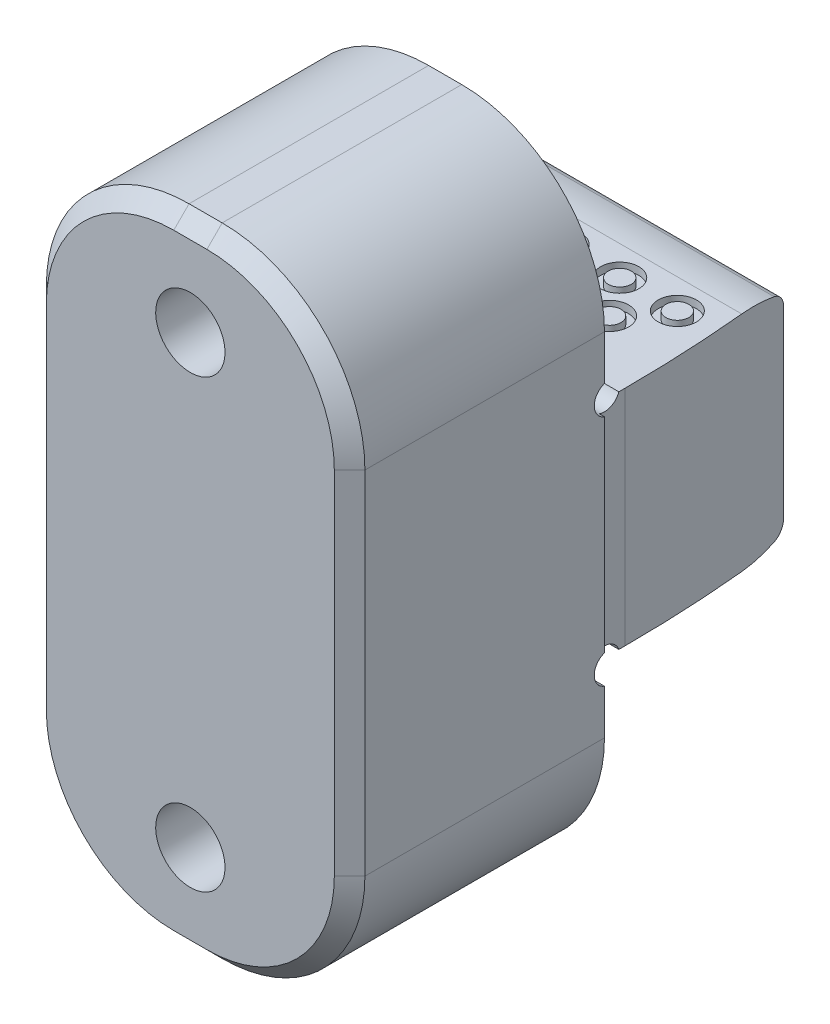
from build123d import *

# Parameters (mm, degrees)
EXTRUDE1_DEPTH        = 7.9375
SKETCH7_W             = 21.968267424
SKETCH7_H             = 31.720833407
CUT_EXTRUDE3_DEPTH    = 0.254
SKETCH8_R             = 0.762
CUT_EXTRUDE4_DEPTH    = 26.793821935
CUT_EXTRUDE5_DEPTH    = 26.793821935
CUT_EXTRUDE6_DEPTH    = 36.104934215
SKETCH15_R            = 0.9525
SKETCH15_R_2          = 0.5715
CUT_EXTRUDE7_DEPTH    = 0.381
F_6_CBORE_D           = 3.302
F_6_CBORE_CBORE_D     = 7.14502
F_6_CBORE_CBORE_DEPTH = 4.30022
FILLET1_R             = 7.112
CHAMFER1_SIZE         = 0.762
F_8_32_TAPPED_HOLE1_D = 3.4544


with BuildPart() as part:
    # Sketch3 → Extrude1 (new, symmetric)
    with BuildSketch(Plane(origin=(0, 0, 0), x_dir=(0, 0, -1), z_dir=(1, 0, 0))):
        Polygon((-12.7, -15.875), (0, -15.875), (0, -5.56006), (9.7536, -5.56006), (9.7536, 5.56006), (0, 5.56006), (0, 15.875), (-12.7, 15.875), align=None)
    extrude(amount=EXTRUDE1_DEPTH, both=True)

    # Sketch7 → Cut-Extrude3 (cut)
    with BuildSketch(Plane(origin=(7.9375, 0, 0), x_dir=(0, 0, -1), z_dir=(1, 0, 0))):
        with Locations((10.984133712, 1.307835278)):
            Rectangle(SKETCH7_W, SKETCH7_H)
    cut_extrude3 = extrude(amount=-CUT_EXTRUDE3_DEPTH, mode=Mode.SUBTRACT)

    # Mirror2: Cut-Extrude3 across plane
    add(cut_extrude3.mirror(Plane(origin=(0, 0, 0), x_dir=(0, 0, 1), z_dir=(1, 0, 0))), mode=Mode.SUBTRACT)

    # Sketch8 → Cut-Extrude4 (cut, through all)
    with BuildSketch(Plane(origin=(7.9375, 0, 0), x_dir=(0, 0, -1), z_dir=(1, 0, 0))):
        with Locations((0.254, 5.81406)):
            Circle(SKETCH8_R)
        with Locations((0.254, -5.81406)):
            Circle(SKETCH8_R)
    extrude(amount=-CUT_EXTRUDE4_DEPTH, mode=Mode.SUBTRACT)

    # Sketch9 → Cut-Extrude5 (cut, through all)
    with BuildSketch(Plane(origin=(7.9375, 0, 0), x_dir=(0, 0, -1), z_dir=(1, 0, 0))):
        with BuildLine():
            Line((9.7536, 4.564040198), (13.7414, 4.564040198))
            Line((13.7414, 4.564040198), (13.7414, 10.914040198))
            Line((13.7414, 10.914040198), (7.3914, 10.914040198))
            Line((7.3914, 10.914040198), (7.3914, 5.56006))
            ThreePointArc((7.3914, 5.56006), (8.31027584, 5.49322538), (9.209809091, 5.294128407))
            ThreePointArc((9.209809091, 5.294128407), (9.602713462, 5.019215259), (9.7536, 4.564040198))
        make_face()
        with BuildLine():
            Line((13.7414, -4.564040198), (13.7414, -10.914040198))
            Line((13.7414, -10.914040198), (7.3914, -10.914040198))
            Line((7.3914, -10.914040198), (7.3914, -5.56006))
            ThreePointArc((7.3914, -5.56006), (8.31027584, -5.49322538), (9.209809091, -5.294128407))
            ThreePointArc((9.209809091, -5.294128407), (9.602713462, -5.019215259), (9.7536, -4.564040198))
            Line((9.7536, -4.564040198), (13.7414, -4.564040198))
        make_face()
    extrude(amount=-CUT_EXTRUDE5_DEPTH, mode=Mode.SUBTRACT)

    # Sketch13 → Cut-Extrude6 (cut, through all)
    with BuildSketch(Plane(origin=(0, 15.875, 0), x_dir=(1, 0, 0), z_dir=(0, 1, 0))):
        with BuildLine():
            Line((6.400539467, 13.97), (19.100539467, 13.97))
            Line((19.100539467, 13.97), (19.100539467, 1.27))
            Line((19.100539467, 1.27), (7.6835, 1.27))
            ThreePointArc((7.6835, 1.27), (7.361945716, 7.652319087), (6.400539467, 13.97))
        make_face()
    extrude(amount=-CUT_EXTRUDE6_DEPTH, mode=Mode.SUBTRACT)

    # Sketch15 → Cut-Extrude7 (cut)
    # profile 1 of 9: a face of its own
    with BuildSketch(Plane(origin=(0, 5.56006, 0), x_dir=(1, 0, 0), z_dir=(0, 1, 0))):
        with Locations(Location((-2.9591, 5.9182, 0), (0, 0, 270))):
            Circle(SKETCH15_R)
        with Locations(Location((-2.9591, 5.9182, 0), (0, 0, 270))):
            Circle(SKETCH15_R_2, mode=Mode.SUBTRACT)
    # profile 2 of 9: a face of its own
    with BuildSketch(Plane(origin=(0, 5.56006, 0), x_dir=(1, 0, 0), z_dir=(0, 1, 0))):
        with Locations(Location((-0.0889, 5.9182, 0), (0, 0, 270))):
            Circle(SKETCH15_R)
        with Locations(Location((-0.0889, 5.9182, 0), (0, 0, 270))):
            Circle(SKETCH15_R_2, mode=Mode.SUBTRACT)
    # profile 3 of 9: a face of its own
    with BuildSketch(Plane(origin=(0, 5.56006, 0), x_dir=(1, 0, 0), z_dir=(0, 1, 0))):
        with Locations(Location((-5.8293, 5.9182, 0), (0, 0, 270))):
            Circle(SKETCH15_R)
        with Locations(Location((-5.8293, 5.9182, 0), (0, 0, 270))):
            Circle(SKETCH15_R_2, mode=Mode.SUBTRACT)
    # profile 4 of 9: a face of its own
    with BuildSketch(Plane(origin=(0, 5.56006, 0), x_dir=(1, 0, 0), z_dir=(0, 1, 0))):
        with Locations(Location((2.7813, 5.9182, 0), (0, 0, 270))):
            Circle(SKETCH15_R)
        with Locations(Location((2.7813, 5.9182, 0), (0, 0, 270))):
            Circle(SKETCH15_R_2, mode=Mode.SUBTRACT)
    # profile 5 of 9: a face of its own
    with BuildSketch(Plane(origin=(0, 5.56006, 0), x_dir=(1, 0, 0), z_dir=(0, 1, 0))):
        with Locations(Location((5.6515, 5.9182, 0), (0, 0, 270))):
            Circle(SKETCH15_R)
        with Locations(Location((5.6515, 5.9182, 0), (0, 0, 270))):
            Circle(SKETCH15_R_2, mode=Mode.SUBTRACT)
    # profile 6 of 9: a face of its own
    with BuildSketch(Plane(origin=(0, 5.56006, 0), x_dir=(1, 0, 0), z_dir=(0, 1, 0))):
        with Locations(Location((-1.5621, 4.0132, 0), (0, 0, 270))):
            Circle(SKETCH15_R)
        with Locations(Location((-1.5621, 4.0132, 0), (0, 0, 270))):
            Circle(SKETCH15_R_2, mode=Mode.SUBTRACT)
    # profile 7 of 9: a face of its own
    with BuildSketch(Plane(origin=(0, 5.56006, 0), x_dir=(1, 0, 0), z_dir=(0, 1, 0))):
        with Locations(Location((1.3081, 4.0132, 0), (0, 0, 270))):
            Circle(SKETCH15_R)
        with Locations(Location((1.3081, 4.0132, 0), (0, 0, 270))):
            Circle(SKETCH15_R_2, mode=Mode.SUBTRACT)
    # profile 8 of 9: a face of its own
    with BuildSketch(Plane(origin=(0, 5.56006, 0), x_dir=(1, 0, 0), z_dir=(0, 1, 0))):
        with Locations(Location((-4.4323, 4.0132, 0), (0, 0, 270))):
            Circle(SKETCH15_R)
        with Locations(Location((-4.4323, 4.0132, 0), (0, 0, 270))):
            Circle(SKETCH15_R_2, mode=Mode.SUBTRACT)
    # profile 9 of 9: a face of its own
    with BuildSketch(Plane(origin=(0, 5.56006, 0), x_dir=(1, 0, 0), z_dir=(0, 1, 0))):
        with Locations(Location((4.1783, 4.0132, 0), (0, 0, 270))):
            Circle(SKETCH15_R)
        with Locations(Location((4.1783, 4.0132, 0), (0, 0, 270))):
            Circle(SKETCH15_R_2, mode=Mode.SUBTRACT)
    cut_extrude7 = extrude(amount=-CUT_EXTRUDE7_DEPTH, mode=Mode.SUBTRACT)

    # Mirror1: Cut-Extrude7 across plane
    add(cut_extrude7.mirror(Plane.ZX), mode=Mode.SUBTRACT)

    # 6 CBORE (through all)
    with Locations(Plane(origin=(0, 0, 0), x_dir=(-1, 0, 0), z_dir=(0, 0, -1))):
        with Locations((0, 11.1125), (0, -11.1125)):
            CounterBoreHole(F_6_CBORE_D / 2, F_6_CBORE_CBORE_D / 2, F_6_CBORE_CBORE_DEPTH)

    # Fillet1
    fillet1_edges = [part.edges().sort_by_distance(p)[0] for p in [
        (-7.9375, -15.875, 6.35),
        (7.9375, 15.875, 6.35),
        (7.9375, -15.875, 6.35),
        (-7.9375, 15.875, 6.35),
    ]]
    fillet(fillet1_edges, radius=FILLET1_R)

    # Chamfer1
    chamfer1_edges = [part.edges().sort_by_distance(p)[0] for p in [
        (7.9375, 0, 12.7),
        (-7.9375, 0, 12.7),
        (0, -15.875, 12.7),
        (0, 15.875, 12.7),
        (-5.854443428, -13.791943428, 12.7),
        (-5.854443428, 13.791943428, 12.7),
        (5.854443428, -13.791943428, 12.7),
        (5.854443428, 13.791943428, 12.7),
    ]]
    chamfer(chamfer1_edges, length=CHAMFER1_SIZE)

    # 8-32 Tapped Hole1 (through all)
    with Locations(Plane(origin=(0, 0, 4.30022), x_dir=(-1, 0, 0), z_dir=(0, 0, -1))):
        with Locations((0, 11.1125), (0, -11.1125)):
            Hole(F_8_32_TAPPED_HOLE1_D / 2)


solid = part.part
